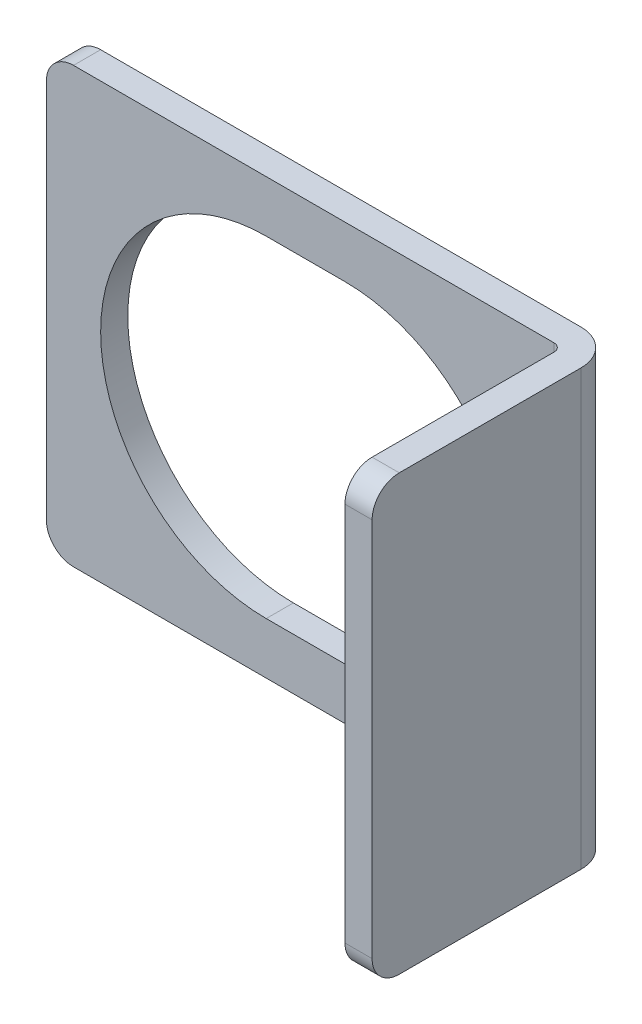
ISO-10303-21;
HEADER;
FILE_DESCRIPTION(('STEP AP214'),'2;1');
FILE_NAME('part.step','',(''),(''),'','','');
FILE_SCHEMA(('AUTOMOTIVE_DESIGN { 1 0 10303 214 1 1 1 1 }'));
ENDSEC;
DATA;
#1=APPLICATION_CONTEXT('core data for automotive mechanical design processes');
#2=APPLICATION_PROTOCOL_DEFINITION('international standard','automotive_design',2000,#1);
#3=PRODUCT_CONTEXT('',#1,'mechanical');
#4=PRODUCT('Part','Part','',(#3));
#5=PRODUCT_RELATED_PRODUCT_CATEGORY('part','',(#4));
#6=PRODUCT_DEFINITION_FORMATION('','',#4);
#7=PRODUCT_DEFINITION_CONTEXT('part definition',#1,'design');
#8=PRODUCT_DEFINITION('design','',#6,#7);
#9=PRODUCT_DEFINITION_SHAPE('','',#8);
#10=(LENGTH_UNIT() NAMED_UNIT(*) SI_UNIT(.MILLI.,.METRE.));
#11=(NAMED_UNIT(*) PLANE_ANGLE_UNIT() SI_UNIT($,.RADIAN.));
#12=(NAMED_UNIT(*) SI_UNIT($,.STERADIAN.) SOLID_ANGLE_UNIT());
#13=UNCERTAINTY_MEASURE_WITH_UNIT(LENGTH_MEASURE(1.E-05),#10,'distance_accuracy_value','');
#14=(GEOMETRIC_REPRESENTATION_CONTEXT(3) GLOBAL_UNCERTAINTY_ASSIGNED_CONTEXT((#13)) GLOBAL_UNIT_ASSIGNED_CONTEXT((#10,
#11,#12)) REPRESENTATION_CONTEXT('',''));
#15=CARTESIAN_POINT('',(0.,0.,0.));
#16=DIRECTION('',(0.,0.,1.));
#17=DIRECTION('',(1.,0.,0.));
#18=AXIS2_PLACEMENT_3D('',#15,#16,#17);
#19=CARTESIAN_POINT('',(8.,8.,1.3));
#20=DIRECTION('',(1.,0.,0.));
#21=DIRECTION('',(0.,1.,0.));
#22=AXIS2_PLACEMENT_3D('',#19,#20,#21);
#23=PLANE('',#22);
#24=DIRECTION('',(0.,0.,1.));
#25=VECTOR('',#24,1.);
#26=CARTESIAN_POINT('',(8.,-8.,1.3));
#27=LINE('',#26,#25);
#28=CARTESIAN_POINT('',(8.,-8.,1.3));
#29=VERTEX_POINT('',#28);
#30=CARTESIAN_POINT('',(8.,-8.,8.));
#31=VERTEX_POINT('',#30);
#32=EDGE_CURVE('E167',#29,#31,#27,.T.);
#33=ORIENTED_EDGE('',*,*,#32,.T.);
#34=CARTESIAN_POINT('',(8.,-7.,8.));
#35=DIRECTION('',(1.,0.,0.));
#36=DIRECTION('',(0.,1.,0.));
#37=AXIS2_PLACEMENT_3D('',#34,#35,#36);
#38=CIRCLE('',#37,1.);
#39=CARTESIAN_POINT('',(8.,-7.,9.));
#40=VERTEX_POINT('',#39);
#41=EDGE_CURVE('E245',#31,#40,#38,.F.);
#42=ORIENTED_EDGE('',*,*,#41,.T.);
#43=DIRECTION('',(0.,-1.,0.));
#44=VECTOR('',#43,1.);
#45=CARTESIAN_POINT('',(8.,8.,9.));
#46=LINE('',#45,#44);
#47=CARTESIAN_POINT('',(8.,7.,9.));
#48=VERTEX_POINT('',#47);
#49=EDGE_CURVE('E218',#48,#40,#46,.T.);
#50=ORIENTED_EDGE('',*,*,#49,.F.);
#51=CARTESIAN_POINT('',(8.,7.,8.));
#52=DIRECTION('',(1.,0.,0.));
#53=DIRECTION('',(0.,1.,0.));
#54=AXIS2_PLACEMENT_3D('',#51,#52,#53);
#55=CIRCLE('',#54,1.);
#56=CARTESIAN_POINT('',(8.,8.,8.));
#57=VERTEX_POINT('',#56);
#58=EDGE_CURVE('E243',#48,#57,#55,.F.);
#59=ORIENTED_EDGE('',*,*,#58,.T.);
#60=DIRECTION('',(0.,0.,1.));
#61=VECTOR('',#60,1.);
#62=CARTESIAN_POINT('',(8.,8.,1.3));
#63=LINE('',#62,#61);
#64=CARTESIAN_POINT('',(8.,8.,1.3));
#65=VERTEX_POINT('',#64);
#66=EDGE_CURVE('E171',#65,#57,#63,.T.);
#67=ORIENTED_EDGE('',*,*,#66,.F.);
#68=DIRECTION('',(0.,-1.,0.));
#69=VECTOR('',#68,1.);
#70=CARTESIAN_POINT('',(8.,8.,1.3));
#71=LINE('',#70,#69);
#72=EDGE_CURVE('E186',#65,#29,#71,.T.);
#73=ORIENTED_EDGE('',*,*,#72,.T.);
#74=EDGE_LOOP('',(#33,#42,#50,#59,#67,#73));
#75=FACE_BOUND('',#74,.T.);
#76=ADVANCED_FACE('F14',(#75),#23,.F.);
#77=CARTESIAN_POINT('',(9.,8.,9.));
#78=DIRECTION('',(0.,0.,1.));
#79=DIRECTION('',(0.,1.,0.));
#80=AXIS2_PLACEMENT_3D('',#77,#78,#79);
#81=PLANE('',#80);
#82=ORIENTED_EDGE('',*,*,#49,.T.);
#83=DIRECTION('',(-1.,0.,0.));
#84=VECTOR('',#83,1.);
#85=CARTESIAN_POINT('',(9.,-7.,9.));
#86=LINE('',#85,#84);
#87=CARTESIAN_POINT('',(9.,-7.,9.));
#88=VERTEX_POINT('',#87);
#89=EDGE_CURVE('E29',#40,#88,#86,.F.);
#90=ORIENTED_EDGE('',*,*,#89,.T.);
#91=DIRECTION('',(0.,-1.,0.));
#92=VECTOR('',#91,1.);
#93=CARTESIAN_POINT('',(9.,8.,9.));
#94=LINE('',#93,#92);
#95=CARTESIAN_POINT('',(9.,7.,9.));
#96=VERTEX_POINT('',#95);
#97=EDGE_CURVE('E216',#96,#88,#94,.T.);
#98=ORIENTED_EDGE('',*,*,#97,.F.);
#99=DIRECTION('',(-1.,0.,0.));
#100=VECTOR('',#99,1.);
#101=CARTESIAN_POINT('',(9.,7.,9.));
#102=LINE('',#101,#100);
#103=EDGE_CURVE('E247',#96,#48,#102,.T.);
#104=ORIENTED_EDGE('',*,*,#103,.T.);
#105=EDGE_LOOP('',(#82,#90,#98,#104));
#106=FACE_BOUND('',#105,.T.);
#107=ADVANCED_FACE('F252',(#106),#81,.T.);
#108=CARTESIAN_POINT('',(9.,8.,1.3));
#109=DIRECTION('',(1.,0.,0.));
#110=DIRECTION('',(0.,1.,0.));
#111=AXIS2_PLACEMENT_3D('',#108,#109,#110);
#112=PLANE('',#111);
#113=ORIENTED_EDGE('',*,*,#97,.T.);
#114=CARTESIAN_POINT('',(9.,-7.,8.));
#115=DIRECTION('',(1.,0.,0.));
#116=DIRECTION('',(0.,1.,0.));
#117=AXIS2_PLACEMENT_3D('',#114,#115,#116);
#118=CIRCLE('',#117,1.);
#119=CARTESIAN_POINT('',(9.,-8.,8.));
#120=VERTEX_POINT('',#119);
#121=EDGE_CURVE('E9',#88,#120,#118,.T.);
#122=ORIENTED_EDGE('',*,*,#121,.T.);
#123=DIRECTION('',(0.,0.,1.));
#124=VECTOR('',#123,1.);
#125=CARTESIAN_POINT('',(9.,-8.,1.3));
#126=LINE('',#125,#124);
#127=CARTESIAN_POINT('',(9.,-8.,1.3));
#128=VERTEX_POINT('',#127);
#129=EDGE_CURVE('E189',#128,#120,#126,.T.);
#130=ORIENTED_EDGE('',*,*,#129,.F.);
#131=DIRECTION('',(0.,-1.,0.));
#132=VECTOR('',#131,1.);
#133=CARTESIAN_POINT('',(9.,8.,1.3));
#134=LINE('',#133,#132);
#135=CARTESIAN_POINT('',(9.,8.,1.3));
#136=VERTEX_POINT('',#135);
#137=EDGE_CURVE('E214',#136,#128,#134,.T.);
#138=ORIENTED_EDGE('',*,*,#137,.F.);
#139=DIRECTION('',(0.,0.,1.));
#140=VECTOR('',#139,1.);
#141=CARTESIAN_POINT('',(9.,8.,1.3));
#142=LINE('',#141,#140);
#143=CARTESIAN_POINT('',(9.,8.,8.));
#144=VERTEX_POINT('',#143);
#145=EDGE_CURVE('E174',#136,#144,#142,.T.);
#146=ORIENTED_EDGE('',*,*,#145,.T.);
#147=CARTESIAN_POINT('',(9.,7.,8.));
#148=DIRECTION('',(1.,0.,0.));
#149=DIRECTION('',(0.,1.,0.));
#150=AXIS2_PLACEMENT_3D('',#147,#148,#149);
#151=CIRCLE('',#150,1.);
#152=EDGE_CURVE('E22',#144,#96,#151,.T.);
#153=ORIENTED_EDGE('',*,*,#152,.T.);
#154=EDGE_LOOP('',(#113,#122,#130,#138,#146,#153));
#155=FACE_BOUND('',#154,.T.);
#156=ADVANCED_FACE('F267',(#155),#112,.T.);
#157=CARTESIAN_POINT('',(7.7,8.,1.3));
#158=DIRECTION('',(0.,-1.,0.));
#159=DIRECTION('',(1.,0.,0.));
#160=AXIS2_PLACEMENT_3D('',#157,#158,#159);
#161=CYLINDRICAL_SURFACE('',#160,1.3);
#162=CARTESIAN_POINT('',(7.7,-8.,1.3));
#163=DIRECTION('',(0.,1.,0.));
#164=DIRECTION('',(-1.,0.,0.));
#165=AXIS2_PLACEMENT_3D('',#162,#163,#164);
#166=CIRCLE('',#165,1.3);
#167=CARTESIAN_POINT('',(7.7,-8.,0.));
#168=VERTEX_POINT('',#167);
#169=EDGE_CURVE('E192',#168,#128,#166,.F.);
#170=ORIENTED_EDGE('',*,*,#169,.F.);
#171=DIRECTION('',(0.,-1.,0.));
#172=VECTOR('',#171,1.);
#173=CARTESIAN_POINT('',(7.7,8.,0.));
#174=LINE('',#173,#172);
#175=CARTESIAN_POINT('',(7.7,8.,0.));
#176=VERTEX_POINT('',#175);
#177=EDGE_CURVE('E211',#176,#168,#174,.T.);
#178=ORIENTED_EDGE('',*,*,#177,.F.);
#179=CARTESIAN_POINT('',(7.7,8.,1.3));
#180=DIRECTION('',(0.,1.,0.));
#181=DIRECTION('',(-1.,0.,0.));
#182=AXIS2_PLACEMENT_3D('',#179,#180,#181);
#183=CIRCLE('',#182,1.3);
#184=EDGE_CURVE('E177',#176,#136,#183,.F.);
#185=ORIENTED_EDGE('',*,*,#184,.T.);
#186=ORIENTED_EDGE('',*,*,#137,.T.);
#187=EDGE_LOOP('',(#170,#178,#185,#186));
#188=FACE_BOUND('',#187,.T.);
#189=ADVANCED_FACE('F276',(#188),#161,.T.);
#190=CARTESIAN_POINT('',(0.,8.,0.));
#191=DIRECTION('',(0.,0.,-1.));
#192=DIRECTION('',(0.,-1.,0.));
#193=AXIS2_PLACEMENT_3D('',#190,#191,#192);
#194=PLANE('',#193);
#195=CARTESIAN_POINT('',(0.,0.,0.));
#196=DIRECTION('',(0.,0.,1.));
#197=DIRECTION('',(1.,0.,0.));
#198=AXIS2_PLACEMENT_3D('',#195,#196,#197);
#199=CIRCLE('',#198,6.1);
#200=CARTESIAN_POINT('',(0.,-6.1,0.));
#201=VERTEX_POINT('',#200);
#202=CARTESIAN_POINT('',(0.,6.1,0.));
#203=VERTEX_POINT('',#202);
#204=EDGE_CURVE('E131',#201,#203,#199,.T.);
#205=ORIENTED_EDGE('',*,*,#204,.T.);
#206=DIRECTION('',(-1.,0.,0.));
#207=VECTOR('',#206,1.);
#208=CARTESIAN_POINT('',(0.,6.1,0.));
#209=LINE('',#208,#207);
#210=CARTESIAN_POINT('',(-2.9,6.1,0.));
#211=VERTEX_POINT('',#210);
#212=EDGE_CURVE('E143',#203,#211,#209,.T.);
#213=ORIENTED_EDGE('',*,*,#212,.T.);
#214=CARTESIAN_POINT('',(-2.9,0.,0.));
#215=DIRECTION('',(0.,0.,1.));
#216=DIRECTION('',(-1.,0.,0.));
#217=AXIS2_PLACEMENT_3D('',#214,#215,#216);
#218=CIRCLE('',#217,6.1);
#219=CARTESIAN_POINT('',(-2.9,-6.1,0.));
#220=VERTEX_POINT('',#219);
#221=EDGE_CURVE('E147',#211,#220,#218,.T.);
#222=ORIENTED_EDGE('',*,*,#221,.T.);
#223=DIRECTION('',(1.,0.,0.));
#224=VECTOR('',#223,1.);
#225=CARTESIAN_POINT('',(0.,-6.1,0.));
#226=LINE('',#225,#224);
#227=EDGE_CURVE('E139',#220,#201,#226,.T.);
#228=ORIENTED_EDGE('',*,*,#227,.T.);
#229=EDGE_LOOP('',(#205,#213,#222,#228));
#230=FACE_BOUND('',#229,.T.);
#231=DIRECTION('',(-1.,0.,0.));
#232=VECTOR('',#231,1.);
#233=CARTESIAN_POINT('',(0.,-8.,0.));
#234=LINE('',#233,#232);
#235=CARTESIAN_POINT('',(-10.,-8.,0.));
#236=VERTEX_POINT('',#235);
#237=EDGE_CURVE('E195',#236,#168,#234,.F.);
#238=ORIENTED_EDGE('',*,*,#237,.F.);
#239=CARTESIAN_POINT('',(-10.,-7.,0.));
#240=DIRECTION('',(0.,0.,-1.));
#241=DIRECTION('',(0.,-1.,0.));
#242=AXIS2_PLACEMENT_3D('',#239,#240,#241);
#243=CIRCLE('',#242,1.);
#244=CARTESIAN_POINT('',(-11.,-7.,0.));
#245=VERTEX_POINT('',#244);
#246=EDGE_CURVE('E228',#236,#245,#243,.T.);
#247=ORIENTED_EDGE('',*,*,#246,.T.);
#248=DIRECTION('',(0.,-1.,0.));
#249=VECTOR('',#248,1.);
#250=CARTESIAN_POINT('',(-11.,8.,0.));
#251=LINE('',#250,#249);
#252=CARTESIAN_POINT('',(-11.,7.,0.));
#253=VERTEX_POINT('',#252);
#254=EDGE_CURVE('E208',#253,#245,#251,.T.);
#255=ORIENTED_EDGE('',*,*,#254,.F.);
#256=CARTESIAN_POINT('',(-10.,7.,0.));
#257=DIRECTION('',(0.,0.,-1.));
#258=DIRECTION('',(0.,-1.,0.));
#259=AXIS2_PLACEMENT_3D('',#256,#257,#258);
#260=CIRCLE('',#259,1.);
#261=CARTESIAN_POINT('',(-10.,8.,0.));
#262=VERTEX_POINT('',#261);
#263=EDGE_CURVE('E226',#253,#262,#260,.T.);
#264=ORIENTED_EDGE('',*,*,#263,.T.);
#265=DIRECTION('',(1.,0.,0.));
#266=VECTOR('',#265,1.);
#267=CARTESIAN_POINT('',(0.,8.,0.));
#268=LINE('',#267,#266);
#269=EDGE_CURVE('E180',#262,#176,#268,.T.);
#270=ORIENTED_EDGE('',*,*,#269,.T.);
#271=ORIENTED_EDGE('',*,*,#177,.T.);
#272=EDGE_LOOP('',(#238,#247,#255,#264,#270,#271));
#273=FACE_BOUND('',#272,.T.);
#274=ADVANCED_FACE('F149',(#230,#273),#194,.T.);
#275=CARTESIAN_POINT('',(-11.,8.,1.));
#276=DIRECTION('',(-1.,0.,0.));
#277=DIRECTION('',(0.,-1.,0.));
#278=AXIS2_PLACEMENT_3D('',#275,#276,#277);
#279=PLANE('',#278);
#280=ORIENTED_EDGE('',*,*,#254,.T.);
#281=DIRECTION('',(0.,0.,-1.));
#282=VECTOR('',#281,1.);
#283=CARTESIAN_POINT('',(-11.,-7.,1.));
#284=LINE('',#283,#282);
#285=CARTESIAN_POINT('',(-11.,-7.,1.));
#286=VERTEX_POINT('',#285);
#287=EDGE_CURVE('E233',#245,#286,#284,.F.);
#288=ORIENTED_EDGE('',*,*,#287,.T.);
#289=DIRECTION('',(0.,-1.,0.));
#290=VECTOR('',#289,1.);
#291=CARTESIAN_POINT('',(-11.,8.,1.));
#292=LINE('',#291,#290);
#293=CARTESIAN_POINT('',(-11.,7.,1.));
#294=VERTEX_POINT('',#293);
#295=EDGE_CURVE('E205',#294,#286,#292,.T.);
#296=ORIENTED_EDGE('',*,*,#295,.F.);
#297=DIRECTION('',(0.,0.,-1.));
#298=VECTOR('',#297,1.);
#299=CARTESIAN_POINT('',(-11.,7.,1.));
#300=LINE('',#299,#298);
#301=EDGE_CURVE('E230',#294,#253,#300,.T.);
#302=ORIENTED_EDGE('',*,*,#301,.T.);
#303=EDGE_LOOP('',(#280,#288,#296,#302));
#304=FACE_BOUND('',#303,.T.);
#305=ADVANCED_FACE('F291',(#304),#279,.T.);
#306=CARTESIAN_POINT('',(0.,8.,1.));
#307=DIRECTION('',(0.,0.,-1.));
#308=DIRECTION('',(-1.,0.,0.));
#309=AXIS2_PLACEMENT_3D('',#306,#307,#308);
#310=PLANE('',#309);
#311=DIRECTION('',(-1.,0.,0.));
#312=VECTOR('',#311,1.);
#313=CARTESIAN_POINT('',(0.,6.1,1.));
#314=LINE('',#313,#312);
#315=CARTESIAN_POINT('',(0.,6.1,1.));
#316=VERTEX_POINT('',#315);
#317=CARTESIAN_POINT('',(-2.9,6.1,1.));
#318=VERTEX_POINT('',#317);
#319=EDGE_CURVE('E161',#316,#318,#314,.T.);
#320=ORIENTED_EDGE('',*,*,#319,.F.);
#321=CARTESIAN_POINT('',(0.,0.,1.));
#322=DIRECTION('',(0.,0.,1.));
#323=DIRECTION('',(1.,0.,0.));
#324=AXIS2_PLACEMENT_3D('',#321,#322,#323);
#325=CIRCLE('',#324,6.1);
#326=CARTESIAN_POINT('',(0.,-6.1,1.));
#327=VERTEX_POINT('',#326);
#328=EDGE_CURVE('E134',#327,#316,#325,.T.);
#329=ORIENTED_EDGE('',*,*,#328,.F.);
#330=DIRECTION('',(1.,0.,0.));
#331=VECTOR('',#330,1.);
#332=CARTESIAN_POINT('',(0.,-6.1,1.));
#333=LINE('',#332,#331);
#334=CARTESIAN_POINT('',(-2.9,-6.1,1.));
#335=VERTEX_POINT('',#334);
#336=EDGE_CURVE('E152',#335,#327,#333,.T.);
#337=ORIENTED_EDGE('',*,*,#336,.F.);
#338=CARTESIAN_POINT('',(-2.9,0.,1.));
#339=DIRECTION('',(0.,0.,1.));
#340=DIRECTION('',(-1.,0.,0.));
#341=AXIS2_PLACEMENT_3D('',#338,#339,#340);
#342=CIRCLE('',#341,6.1);
#343=EDGE_CURVE('E155',#318,#335,#342,.T.);
#344=ORIENTED_EDGE('',*,*,#343,.F.);
#345=EDGE_LOOP('',(#320,#329,#337,#344));
#346=FACE_BOUND('',#345,.T.);
#347=ORIENTED_EDGE('',*,*,#295,.T.);
#348=CARTESIAN_POINT('',(-10.,-7.,1.));
#349=DIRECTION('',(0.,0.,-1.));
#350=DIRECTION('',(-1.,0.,0.));
#351=AXIS2_PLACEMENT_3D('',#348,#349,#350);
#352=CIRCLE('',#351,1.);
#353=CARTESIAN_POINT('',(-10.,-8.,1.));
#354=VERTEX_POINT('',#353);
#355=EDGE_CURVE('E237',#286,#354,#352,.F.);
#356=ORIENTED_EDGE('',*,*,#355,.T.);
#357=DIRECTION('',(1.,0.,0.));
#358=VECTOR('',#357,1.);
#359=CARTESIAN_POINT('',(0.,-8.,1.));
#360=LINE('',#359,#358);
#361=CARTESIAN_POINT('',(7.7,-8.,1.));
#362=VERTEX_POINT('',#361);
#363=EDGE_CURVE('E197',#354,#362,#360,.T.);
#364=ORIENTED_EDGE('',*,*,#363,.T.);
#365=DIRECTION('',(0.,-1.,0.));
#366=VECTOR('',#365,1.);
#367=CARTESIAN_POINT('',(7.7,8.,1.));
#368=LINE('',#367,#366);
#369=CARTESIAN_POINT('',(7.7,8.,1.));
#370=VERTEX_POINT('',#369);
#371=EDGE_CURVE('E202',#370,#362,#368,.T.);
#372=ORIENTED_EDGE('',*,*,#371,.F.);
#373=DIRECTION('',(1.,0.,0.));
#374=VECTOR('',#373,1.);
#375=CARTESIAN_POINT('',(0.,8.,1.));
#376=LINE('',#375,#374);
#377=CARTESIAN_POINT('',(-10.,8.,1.));
#378=VERTEX_POINT('',#377);
#379=EDGE_CURVE('E182',#378,#370,#376,.T.);
#380=ORIENTED_EDGE('',*,*,#379,.F.);
#381=CARTESIAN_POINT('',(-10.,7.,1.));
#382=DIRECTION('',(0.,0.,-1.));
#383=DIRECTION('',(-1.,0.,0.));
#384=AXIS2_PLACEMENT_3D('',#381,#382,#383);
#385=CIRCLE('',#384,1.);
#386=EDGE_CURVE('E235',#378,#294,#385,.F.);
#387=ORIENTED_EDGE('',*,*,#386,.T.);
#388=EDGE_LOOP('',(#347,#356,#364,#372,#380,#387));
#389=FACE_BOUND('',#388,.T.);
#390=ADVANCED_FACE('F287',(#346,#389),#310,.F.);
#391=CARTESIAN_POINT('',(7.7,8.,1.3));
#392=DIRECTION('',(0.,-1.,0.));
#393=DIRECTION('',(1.,0.,0.));
#394=AXIS2_PLACEMENT_3D('',#391,#392,#393);
#395=CYLINDRICAL_SURFACE('',#394,0.3);
#396=CARTESIAN_POINT('',(7.7,-8.,1.3));
#397=DIRECTION('',(0.,-1.,0.));
#398=DIRECTION('',(1.,0.,0.));
#399=AXIS2_PLACEMENT_3D('',#396,#397,#398);
#400=CIRCLE('',#399,0.3);
#401=EDGE_CURVE('E175',#362,#29,#400,.T.);
#402=ORIENTED_EDGE('',*,*,#401,.T.);
#403=ORIENTED_EDGE('',*,*,#72,.F.);
#404=CARTESIAN_POINT('',(7.7,8.,1.3));
#405=DIRECTION('',(0.,-1.,0.));
#406=DIRECTION('',(1.,0.,0.));
#407=AXIS2_PLACEMENT_3D('',#404,#405,#406);
#408=CIRCLE('',#407,0.3);
#409=EDGE_CURVE('E184',#370,#65,#408,.T.);
#410=ORIENTED_EDGE('',*,*,#409,.F.);
#411=ORIENTED_EDGE('',*,*,#371,.T.);
#412=EDGE_LOOP('',(#402,#403,#410,#411));
#413=FACE_BOUND('',#412,.T.);
#414=ADVANCED_FACE('F298',(#413),#395,.F.);
#415=CARTESIAN_POINT('',(7.7,8.,1.3));
#416=DIRECTION('',(0.,1.,0.));
#417=DIRECTION('',(-1.,0.,0.));
#418=AXIS2_PLACEMENT_3D('',#415,#416,#417);
#419=PLANE('',#418);
#420=ORIENTED_EDGE('',*,*,#269,.F.);
#421=DIRECTION('',(0.,0.,-1.));
#422=VECTOR('',#421,1.);
#423=CARTESIAN_POINT('',(-10.,8.,1.3));
#424=LINE('',#423,#422);
#425=EDGE_CURVE('E241',#262,#378,#424,.F.);
#426=ORIENTED_EDGE('',*,*,#425,.T.);
#427=ORIENTED_EDGE('',*,*,#379,.T.);
#428=ORIENTED_EDGE('',*,*,#409,.T.);
#429=ORIENTED_EDGE('',*,*,#66,.T.);
#430=DIRECTION('',(-1.,0.,0.));
#431=VECTOR('',#430,1.);
#432=CARTESIAN_POINT('',(7.7,8.,8.));
#433=LINE('',#432,#431);
#434=EDGE_CURVE('E239',#57,#144,#433,.F.);
#435=ORIENTED_EDGE('',*,*,#434,.T.);
#436=ORIENTED_EDGE('',*,*,#145,.F.);
#437=ORIENTED_EDGE('',*,*,#184,.F.);
#438=EDGE_LOOP('',(#420,#426,#427,#428,#429,#435,#436,#437));
#439=FACE_BOUND('',#438,.T.);
#440=ADVANCED_FACE('F273',(#439),#419,.T.);
#441=CARTESIAN_POINT('',(7.7,-8.,1.3));
#442=DIRECTION('',(0.,1.,0.));
#443=DIRECTION('',(-1.,0.,0.));
#444=AXIS2_PLACEMENT_3D('',#441,#442,#443);
#445=PLANE('',#444);
#446=ORIENTED_EDGE('',*,*,#363,.F.);
#447=DIRECTION('',(0.,0.,-1.));
#448=VECTOR('',#447,1.);
#449=CARTESIAN_POINT('',(-10.,-8.,0.));
#450=LINE('',#449,#448);
#451=EDGE_CURVE('E223',#354,#236,#450,.T.);
#452=ORIENTED_EDGE('',*,*,#451,.T.);
#453=ORIENTED_EDGE('',*,*,#237,.T.);
#454=ORIENTED_EDGE('',*,*,#169,.T.);
#455=ORIENTED_EDGE('',*,*,#129,.T.);
#456=DIRECTION('',(-1.,0.,0.));
#457=VECTOR('',#456,1.);
#458=CARTESIAN_POINT('',(8.,-8.,8.));
#459=LINE('',#458,#457);
#460=EDGE_CURVE('E220',#120,#31,#459,.T.);
#461=ORIENTED_EDGE('',*,*,#460,.T.);
#462=ORIENTED_EDGE('',*,*,#32,.F.);
#463=ORIENTED_EDGE('',*,*,#401,.F.);
#464=EDGE_LOOP('',(#446,#452,#453,#454,#455,#461,#462,#463));
#465=FACE_BOUND('',#464,.T.);
#466=ADVANCED_FACE('F263',(#465),#445,.F.);
#467=CARTESIAN_POINT('',(0.,0.,0.));
#468=DIRECTION('',(0.,0.,1.));
#469=DIRECTION('',(1.,0.,0.));
#470=AXIS2_PLACEMENT_3D('',#467,#468,#469);
#471=CYLINDRICAL_SURFACE('',#470,6.1);
#472=ORIENTED_EDGE('',*,*,#328,.T.);
#473=DIRECTION('',(0.,0.,1.));
#474=VECTOR('',#473,1.);
#475=CARTESIAN_POINT('',(0.,6.1,0.));
#476=LINE('',#475,#474);
#477=EDGE_CURVE('E127',#203,#316,#476,.T.);
#478=ORIENTED_EDGE('',*,*,#477,.F.);
#479=ORIENTED_EDGE('',*,*,#204,.F.);
#480=DIRECTION('',(0.,0.,1.));
#481=VECTOR('',#480,1.);
#482=CARTESIAN_POINT('',(0.,-6.1,0.));
#483=LINE('',#482,#481);
#484=EDGE_CURVE('E165',#201,#327,#483,.T.);
#485=ORIENTED_EDGE('',*,*,#484,.T.);
#486=EDGE_LOOP('',(#472,#478,#479,#485));
#487=FACE_BOUND('',#486,.T.);
#488=ADVANCED_FACE('F129',(#487),#471,.F.);
#489=CARTESIAN_POINT('',(0.,-6.1,0.));
#490=DIRECTION('',(0.,-1.,0.));
#491=DIRECTION('',(1.,0.,0.));
#492=AXIS2_PLACEMENT_3D('',#489,#490,#491);
#493=PLANE('',#492);
#494=ORIENTED_EDGE('',*,*,#336,.T.);
#495=ORIENTED_EDGE('',*,*,#484,.F.);
#496=ORIENTED_EDGE('',*,*,#227,.F.);
#497=DIRECTION('',(0.,0.,1.));
#498=VECTOR('',#497,1.);
#499=CARTESIAN_POINT('',(-2.9,-6.1,0.));
#500=LINE('',#499,#498);
#501=EDGE_CURVE('E168',#220,#335,#500,.T.);
#502=ORIENTED_EDGE('',*,*,#501,.T.);
#503=EDGE_LOOP('',(#494,#495,#496,#502));
#504=FACE_BOUND('',#503,.T.);
#505=ADVANCED_FACE('F368',(#504),#493,.F.);
#506=CARTESIAN_POINT('',(-2.9,0.,0.));
#507=DIRECTION('',(0.,0.,1.));
#508=DIRECTION('',(1.,0.,0.));
#509=AXIS2_PLACEMENT_3D('',#506,#507,#508);
#510=CYLINDRICAL_SURFACE('',#509,6.1);
#511=ORIENTED_EDGE('',*,*,#343,.T.);
#512=ORIENTED_EDGE('',*,*,#501,.F.);
#513=ORIENTED_EDGE('',*,*,#221,.F.);
#514=DIRECTION('',(0.,0.,1.));
#515=VECTOR('',#514,1.);
#516=CARTESIAN_POINT('',(-2.9,6.1,0.));
#517=LINE('',#516,#515);
#518=EDGE_CURVE('E138',#211,#318,#517,.T.);
#519=ORIENTED_EDGE('',*,*,#518,.T.);
#520=EDGE_LOOP('',(#511,#512,#513,#519));
#521=FACE_BOUND('',#520,.T.);
#522=ADVANCED_FACE('F361',(#521),#510,.F.);
#523=CARTESIAN_POINT('',(0.,6.1,0.));
#524=DIRECTION('',(0.,1.,0.));
#525=DIRECTION('',(-1.,0.,0.));
#526=AXIS2_PLACEMENT_3D('',#523,#524,#525);
#527=PLANE('',#526);
#528=ORIENTED_EDGE('',*,*,#319,.T.);
#529=ORIENTED_EDGE('',*,*,#518,.F.);
#530=ORIENTED_EDGE('',*,*,#212,.F.);
#531=ORIENTED_EDGE('',*,*,#477,.T.);
#532=EDGE_LOOP('',(#528,#529,#530,#531));
#533=FACE_BOUND('',#532,.T.);
#534=ADVANCED_FACE('F144',(#533),#527,.F.);
#535=CARTESIAN_POINT('',(-10.,-7.,1.3));
#536=DIRECTION('',(0.,0.,1.));
#537=DIRECTION('',(0.,1.,0.));
#538=AXIS2_PLACEMENT_3D('',#535,#536,#537);
#539=CYLINDRICAL_SURFACE('',#538,1.);
#540=ORIENTED_EDGE('',*,*,#355,.F.);
#541=ORIENTED_EDGE('',*,*,#287,.F.);
#542=ORIENTED_EDGE('',*,*,#246,.F.);
#543=ORIENTED_EDGE('',*,*,#451,.F.);
#544=EDGE_LOOP('',(#540,#541,#542,#543));
#545=FACE_BOUND('',#544,.T.);
#546=ADVANCED_FACE('F294',(#545),#539,.T.);
#547=CARTESIAN_POINT('',(-10.,7.,1.));
#548=DIRECTION('',(0.,0.,-1.));
#549=DIRECTION('',(0.,-1.,0.));
#550=AXIS2_PLACEMENT_3D('',#547,#548,#549);
#551=CYLINDRICAL_SURFACE('',#550,1.);
#552=ORIENTED_EDGE('',*,*,#386,.F.);
#553=ORIENTED_EDGE('',*,*,#425,.F.);
#554=ORIENTED_EDGE('',*,*,#263,.F.);
#555=ORIENTED_EDGE('',*,*,#301,.F.);
#556=EDGE_LOOP('',(#552,#553,#554,#555));
#557=FACE_BOUND('',#556,.T.);
#558=ADVANCED_FACE('F283',(#557),#551,.T.);
#559=CARTESIAN_POINT('',(7.7,-7.,8.));
#560=DIRECTION('',(1.,0.,0.));
#561=DIRECTION('',(0.,1.,0.));
#562=AXIS2_PLACEMENT_3D('',#559,#560,#561);
#563=CYLINDRICAL_SURFACE('',#562,1.);
#564=ORIENTED_EDGE('',*,*,#121,.F.);
#565=ORIENTED_EDGE('',*,*,#89,.F.);
#566=ORIENTED_EDGE('',*,*,#41,.F.);
#567=ORIENTED_EDGE('',*,*,#460,.F.);
#568=EDGE_LOOP('',(#564,#565,#566,#567));
#569=FACE_BOUND('',#568,.T.);
#570=ADVANCED_FACE('F260',(#569),#563,.T.);
#571=CARTESIAN_POINT('',(9.,7.,8.));
#572=DIRECTION('',(-1.,0.,0.));
#573=DIRECTION('',(0.,-1.,0.));
#574=AXIS2_PLACEMENT_3D('',#571,#572,#573);
#575=CYLINDRICAL_SURFACE('',#574,1.);
#576=ORIENTED_EDGE('',*,*,#152,.F.);
#577=ORIENTED_EDGE('',*,*,#434,.F.);
#578=ORIENTED_EDGE('',*,*,#58,.F.);
#579=ORIENTED_EDGE('',*,*,#103,.F.);
#580=EDGE_LOOP('',(#576,#577,#578,#579));
#581=FACE_BOUND('',#580,.T.);
#582=ADVANCED_FACE('F16',(#581),#575,.T.);
#583=CLOSED_SHELL('',(#76,#107,#156,#189,#274,#305,#390,#414,#440,#466,#488,#505,#522,#534,#546,
#558,#570,#582));
#584=MANIFOLD_SOLID_BREP('B1',#583);
#585=ADVANCED_BREP_SHAPE_REPRESENTATION('',(#18,#584),#14);
#586=SHAPE_DEFINITION_REPRESENTATION(#9,#585);
ENDSEC;
END-ISO-10303-21;
